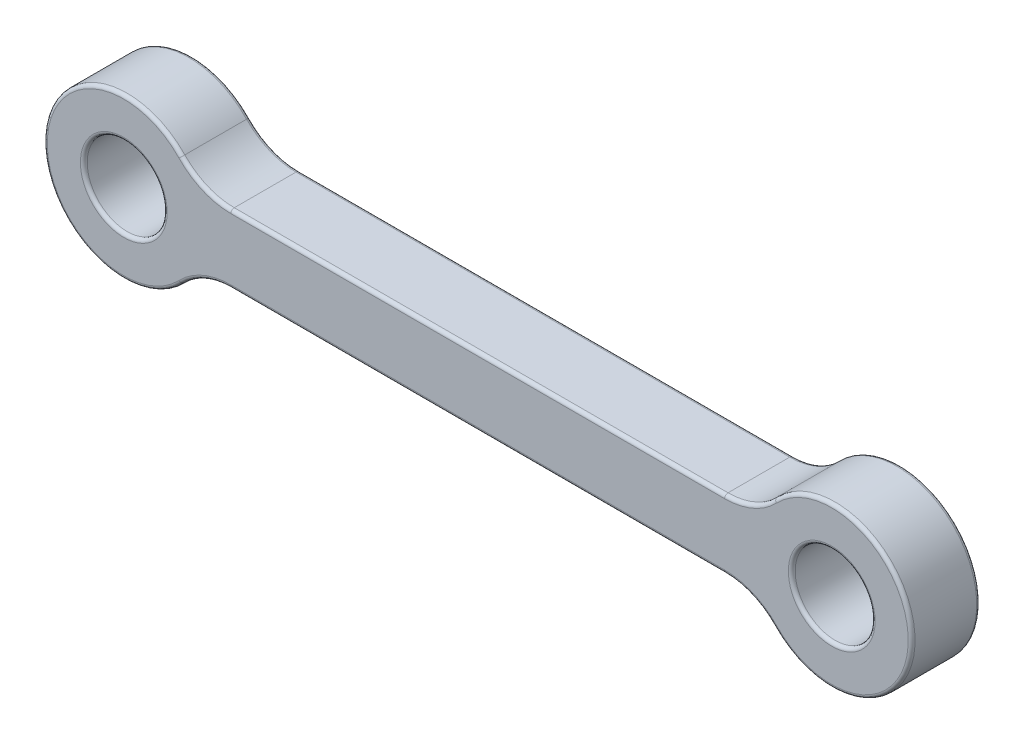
from build123d import *

# Parameters (mm, degrees)
SKETCH_1_R      = 3.5
SKETCH_1_R_2    = 1.75
EXTRUDE_1_DEPTH = 1.5
FILLET_1_R      = 3
FILLET_2_R      = 0.15


with BuildPart() as part:
    # Sketch 1 → Extrude 1 (new, symmetric)
    # profile 1 of 3: a face of its own
    with BuildSketch(Plane.XY):
        Circle(SKETCH_1_R)
        Circle(SKETCH_1_R_2, mode=Mode.SUBTRACT)
    # profile 2 of 3: a face of its own
    with BuildSketch(Plane.XY):
        with BuildLine():
            Line((3.16227766, -1.5), (27.83772234, -1.5))
            ThreePointArc((27.83772234, -1.5), (27.5, 0), (27.83772234, 1.5))
            Line((27.83772234, 1.5), (3.16227766, 1.5))
            ThreePointArc((3.16227766, 1.5), (3.414525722, 0.768774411), (3.5, 0))
            ThreePointArc((3.5, 0), (3.414525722, -0.768774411), (3.16227766, -1.5))
        make_face()
    # profile 3 of 3: a face of its own
    with BuildSketch(Plane.XY):
        with Locations((31, 0)):
            Circle(SKETCH_1_R)
        with Locations((31, 0)):
            Circle(SKETCH_1_R_2, mode=Mode.SUBTRACT)
    extrude(amount=EXTRUDE_1_DEPTH, both=True)

    # Fillet 1
    fillet_1_edges = [part.edges().sort_by_distance(p)[0] for p in [
        (3.16227766, 1.5, 0),
        (27.83772234, 1.5, 0),
        (27.83772234, -1.5, 0),
        (3.16227766, -1.5, 0),
    ]]
    fillet(fillet_1_edges, radius=FILLET_1_R)

    # Fillet 2
    fillet_2_edges = [part.edges().sort_by_distance(p)[0] for p in [
        (-1.75, 0, -1.5),
        (-3.5, 0, -1.5),
        (-3.5, 0, 1.5),
        (15.5, 1.5, -1.5),
        (15.5, 1.5, 1.5),
        (34.5, 0, -1.5),
        (34.5, 0, 1.5),
        (15.5, -1.5, -1.5),
        (15.5, -1.5, 1.5),
        (3.513718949, 1.740401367, -1.5),
        (29.25, 0, 1.5),
        (3.513718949, 1.740401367, 1.5),
        (27.486281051, 1.740401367, -1.5),
        (27.486281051, 1.740401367, 1.5),
        (3.513718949, -1.740401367, -1.5),
        (3.513718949, -1.740401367, 1.5),
        (27.486281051, -1.740401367, -1.5),
        (27.486281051, -1.740401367, 1.5),
        (-1.75, 0, 1.5),
        (29.25, 0, -1.5),
    ]]
    fillet(fillet_2_edges, radius=FILLET_2_R)


solid = part.part
